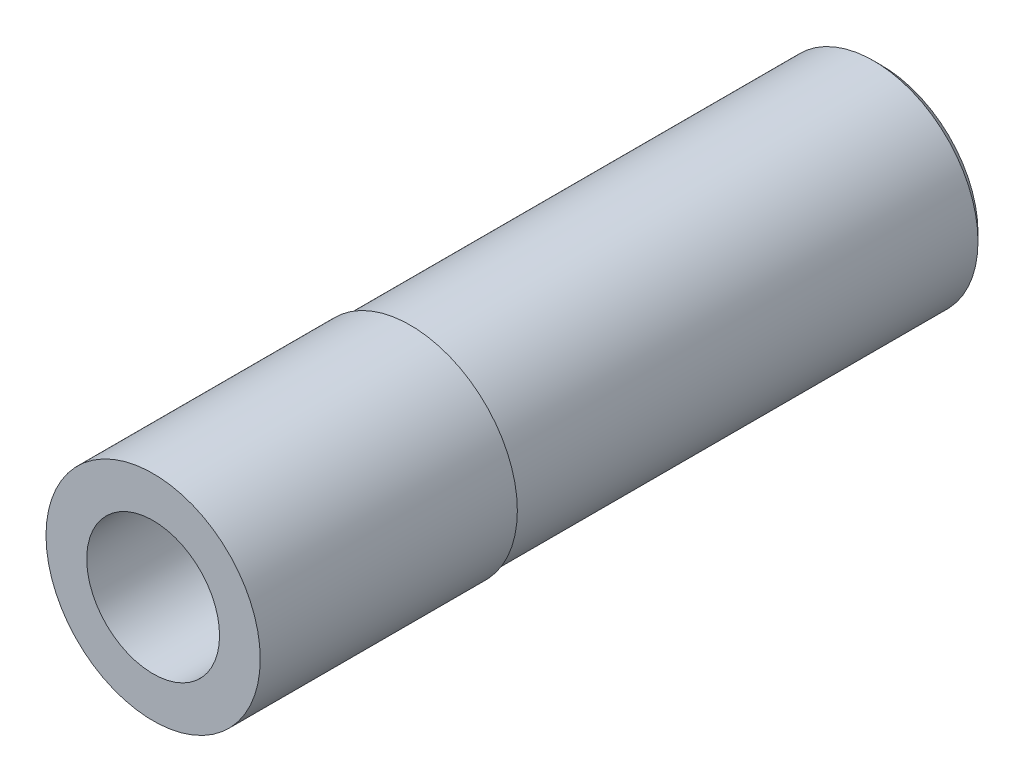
ISO-10303-21;
HEADER;
FILE_DESCRIPTION(('STEP AP214'),'2;1');
FILE_NAME('part.step','',(''),(''),'','','');
FILE_SCHEMA(('AUTOMOTIVE_DESIGN { 1 0 10303 214 1 1 1 1 }'));
ENDSEC;
DATA;
#1=APPLICATION_CONTEXT('core data for automotive mechanical design processes');
#2=APPLICATION_PROTOCOL_DEFINITION('international standard','automotive_design',2000,#1);
#3=PRODUCT_CONTEXT('',#1,'mechanical');
#4=PRODUCT('Part','Part','',(#3));
#5=PRODUCT_RELATED_PRODUCT_CATEGORY('part','',(#4));
#6=PRODUCT_DEFINITION_FORMATION('','',#4);
#7=PRODUCT_DEFINITION_CONTEXT('part definition',#1,'design');
#8=PRODUCT_DEFINITION('design','',#6,#7);
#9=PRODUCT_DEFINITION_SHAPE('','',#8);
#10=(LENGTH_UNIT() NAMED_UNIT(*) SI_UNIT(.MILLI.,.METRE.));
#11=(NAMED_UNIT(*) PLANE_ANGLE_UNIT() SI_UNIT($,.RADIAN.));
#12=(NAMED_UNIT(*) SI_UNIT($,.STERADIAN.) SOLID_ANGLE_UNIT());
#13=UNCERTAINTY_MEASURE_WITH_UNIT(LENGTH_MEASURE(1.E-05),#10,'distance_accuracy_value','');
#14=(GEOMETRIC_REPRESENTATION_CONTEXT(3) GLOBAL_UNCERTAINTY_ASSIGNED_CONTEXT((#13)) GLOBAL_UNIT_ASSIGNED_CONTEXT((#10,
#11,#12)) REPRESENTATION_CONTEXT('',''));
#15=CARTESIAN_POINT('',(0.,0.,0.));
#16=DIRECTION('',(0.,0.,1.));
#17=DIRECTION('',(1.,0.,0.));
#18=AXIS2_PLACEMENT_3D('',#15,#16,#17);
#19=CARTESIAN_POINT('',(0.,0.,3.79790950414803));
#20=DIRECTION('',(0.,0.,1.));
#21=DIRECTION('',(1.,0.,0.));
#22=AXIS2_PLACEMENT_3D('',#19,#20,#21);
#23=CYLINDRICAL_SURFACE('',#22,0.799999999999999);
#24=CARTESIAN_POINT('',(0.,0.,-14.));
#25=DIRECTION('',(0.,0.,1.));
#26=DIRECTION('',(1.,0.,0.));
#27=AXIS2_PLACEMENT_3D('',#24,#25,#26);
#28=CIRCLE('',#27,0.8);
#29=CARTESIAN_POINT('',(0.8,0.,-14.));
#30=VERTEX_POINT('',#29);
#31=EDGE_CURVE('E185',#30,#30,#28,.T.);
#32=ORIENTED_EDGE('',*,*,#31,.F.);
#33=EDGE_LOOP('',(#32));
#34=FACE_BOUND('',#33,.T.);
#35=CARTESIAN_POINT('',(0.,0.,-4.2));
#36=DIRECTION('',(0.,0.,1.));
#37=DIRECTION('',(1.,0.,0.));
#38=AXIS2_PLACEMENT_3D('',#35,#36,#37);
#39=CIRCLE('',#38,0.799999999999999);
#40=CARTESIAN_POINT('',(0.69282032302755,-0.399999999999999,-4.2));
#41=VERTEX_POINT('',#40);
#42=CARTESIAN_POINT('',(0.,-0.799999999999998,-4.2));
#43=VERTEX_POINT('',#42);
#44=EDGE_CURVE('E11',#41,#43,#39,.F.);
#45=ORIENTED_EDGE('',*,*,#44,.F.);
#46=CARTESIAN_POINT('',(0.69282032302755,0.399999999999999,-4.2));
#47=VERTEX_POINT('',#46);
#48=EDGE_CURVE('E38',#47,#41,#39,.F.);
#49=ORIENTED_EDGE('',*,*,#48,.F.);
#50=CARTESIAN_POINT('',(0.,0.799999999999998,-4.2));
#51=VERTEX_POINT('',#50);
#52=EDGE_CURVE('E111',#51,#47,#39,.F.);
#53=ORIENTED_EDGE('',*,*,#52,.F.);
#54=CARTESIAN_POINT('',(-0.69282032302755,0.399999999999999,-4.2));
#55=VERTEX_POINT('',#54);
#56=EDGE_CURVE('E296',#55,#51,#39,.F.);
#57=ORIENTED_EDGE('',*,*,#56,.F.);
#58=CARTESIAN_POINT('',(-0.692820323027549,-0.399999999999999,-4.2));
#59=VERTEX_POINT('',#58);
#60=EDGE_CURVE('E294',#59,#55,#39,.F.);
#61=ORIENTED_EDGE('',*,*,#60,.F.);
#62=EDGE_CURVE('E43',#43,#59,#39,.F.);
#63=ORIENTED_EDGE('',*,*,#62,.F.);
#64=EDGE_LOOP('',(#45,#49,#53,#57,#61,#63));
#65=FACE_BOUND('',#64,.T.);
#66=ADVANCED_FACE('F34',(#34,#65),#23,.F.);
#67=CARTESIAN_POINT('',(0.,0.,3.79790950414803));
#68=DIRECTION('',(0.,0.,1.));
#69=DIRECTION('',(1.,0.,0.));
#70=AXIS2_PLACEMENT_3D('',#67,#68,#69);
#71=CYLINDRICAL_SURFACE('',#70,2.5);
#72=CARTESIAN_POINT('',(0.,0.,0.));
#73=DIRECTION('',(0.,0.,1.));
#74=DIRECTION('',(1.,0.,0.));
#75=AXIS2_PLACEMENT_3D('',#72,#73,#74);
#76=CIRCLE('',#75,2.5);
#77=CARTESIAN_POINT('',(2.5,0.,0.));
#78=VERTEX_POINT('',#77);
#79=EDGE_CURVE('E194',#78,#78,#76,.T.);
#80=ORIENTED_EDGE('',*,*,#79,.F.);
#81=EDGE_LOOP('',(#80));
#82=FACE_BOUND('',#81,.T.);
#83=CARTESIAN_POINT('',(0.,0.,-6.));
#84=DIRECTION('',(0.,0.,-1.));
#85=DIRECTION('',(-1.,0.,0.));
#86=AXIS2_PLACEMENT_3D('',#83,#84,#85);
#87=CIRCLE('',#86,2.5);
#88=CARTESIAN_POINT('',(-2.5,0.,-6.));
#89=VERTEX_POINT('',#88);
#90=EDGE_CURVE('E179',#89,#89,#87,.T.);
#91=ORIENTED_EDGE('',*,*,#90,.F.);
#92=EDGE_LOOP('',(#91));
#93=FACE_BOUND('',#92,.T.);
#94=ADVANCED_FACE('F36',(#82,#93),#71,.T.);
#95=CARTESIAN_POINT('',(0.,0.,-17.));
#96=DIRECTION('',(0.,0.,1.));
#97=DIRECTION('',(1.,0.,0.));
#98=AXIS2_PLACEMENT_3D('',#95,#96,#97);
#99=CONICAL_SURFACE('',#98,2.2499999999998,0.785398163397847);
#100=CARTESIAN_POINT('',(0.,0.,-17.));
#101=DIRECTION('',(0.,0.,1.));
#102=DIRECTION('',(1.,0.,0.));
#103=AXIS2_PLACEMENT_3D('',#100,#101,#102);
#104=CIRCLE('',#103,2.2499999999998);
#105=CARTESIAN_POINT('',(2.2499999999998,0.,-17.));
#106=VERTEX_POINT('',#105);
#107=EDGE_CURVE('E175',#106,#106,#104,.T.);
#108=ORIENTED_EDGE('',*,*,#107,.T.);
#109=EDGE_LOOP('',(#108));
#110=FACE_BOUND('',#109,.T.);
#111=CARTESIAN_POINT('',(0.,0.,-16.815));
#112=DIRECTION('',(0.,0.,1.));
#113=DIRECTION('',(1.,0.,0.));
#114=AXIS2_PLACEMENT_3D('',#111,#112,#113);
#115=CIRCLE('',#114,2.435);
#116=CARTESIAN_POINT('',(2.435,0.,-16.815));
#117=VERTEX_POINT('',#116);
#118=EDGE_CURVE('E174',#117,#117,#115,.T.);
#119=ORIENTED_EDGE('',*,*,#118,.F.);
#120=EDGE_LOOP('',(#119));
#121=FACE_BOUND('',#120,.T.);
#122=ADVANCED_FACE('F204',(#110,#121),#99,.T.);
#123=CARTESIAN_POINT('',(0.,2.5,0.));
#124=DIRECTION('',(0.,0.,-1.));
#125=DIRECTION('',(-1.,0.,0.));
#126=AXIS2_PLACEMENT_3D('',#123,#124,#125);
#127=PLANE('',#126);
#128=CARTESIAN_POINT('',(0.,0.,0.));
#129=DIRECTION('',(0.,0.,1.));
#130=DIRECTION('',(1.,0.,0.));
#131=AXIS2_PLACEMENT_3D('',#128,#129,#130);
#132=CIRCLE('',#131,1.55);
#133=CARTESIAN_POINT('',(1.55,0.,0.));
#134=VERTEX_POINT('',#133);
#135=EDGE_CURVE('E191',#134,#134,#132,.T.);
#136=ORIENTED_EDGE('',*,*,#135,.F.);
#137=EDGE_LOOP('',(#136));
#138=FACE_BOUND('',#137,.T.);
#139=ORIENTED_EDGE('',*,*,#79,.T.);
#140=EDGE_LOOP('',(#139));
#141=FACE_BOUND('',#140,.T.);
#142=ADVANCED_FACE('F210',(#138,#141),#127,.F.);
#143=CARTESIAN_POINT('',(0.,0.,3.79790950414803));
#144=DIRECTION('',(0.,0.,1.));
#145=DIRECTION('',(1.,0.,0.));
#146=AXIS2_PLACEMENT_3D('',#143,#144,#145);
#147=CYLINDRICAL_SURFACE('',#146,1.55);
#148=CARTESIAN_POINT('',(0.,0.,-2.8));
#149=DIRECTION('',(0.,0.,1.));
#150=DIRECTION('',(1.,0.,0.));
#151=AXIS2_PLACEMENT_3D('',#148,#149,#150);
#152=CIRCLE('',#151,1.55);
#153=CARTESIAN_POINT('',(1.55,0.,-2.8));
#154=VERTEX_POINT('',#153);
#155=EDGE_CURVE('E188',#154,#154,#152,.T.);
#156=ORIENTED_EDGE('',*,*,#155,.F.);
#157=EDGE_LOOP('',(#156));
#158=FACE_BOUND('',#157,.T.);
#159=ORIENTED_EDGE('',*,*,#135,.T.);
#160=EDGE_LOOP('',(#159));
#161=FACE_BOUND('',#160,.T.);
#162=ADVANCED_FACE('F218',(#158,#161),#147,.F.);
#163=CARTESIAN_POINT('',(0.,1.55,-2.8));
#164=DIRECTION('',(0.,0.,-1.));
#165=DIRECTION('',(-1.,0.,0.));
#166=AXIS2_PLACEMENT_3D('',#163,#164,#165);
#167=PLANE('',#166);
#168=DIRECTION('',(-1.,0.,0.));
#169=VECTOR('',#168,1.);
#170=CARTESIAN_POINT('',(0.4618802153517,0.799999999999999,-2.8));
#171=LINE('',#170,#169);
#172=CARTESIAN_POINT('',(0.4618802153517,0.799999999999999,-2.8));
#173=VERTEX_POINT('',#172);
#174=CARTESIAN_POINT('',(-0.4618802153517,0.799999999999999,-2.8));
#175=VERTEX_POINT('',#174);
#176=EDGE_CURVE('E50',#173,#175,#171,.T.);
#177=ORIENTED_EDGE('',*,*,#176,.F.);
#178=DIRECTION('',(-0.5,0.866025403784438,0.));
#179=VECTOR('',#178,1.);
#180=CARTESIAN_POINT('',(0.9237604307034,0.,-2.8));
#181=LINE('',#180,#179);
#182=CARTESIAN_POINT('',(0.9237604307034,0.,-2.8));
#183=VERTEX_POINT('',#182);
#184=EDGE_CURVE('E120',#183,#173,#181,.T.);
#185=ORIENTED_EDGE('',*,*,#184,.F.);
#186=DIRECTION('',(0.5,0.866025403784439,0.));
#187=VECTOR('',#186,1.);
#188=CARTESIAN_POINT('',(0.4618802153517,-0.799999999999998,-2.8));
#189=LINE('',#188,#187);
#190=CARTESIAN_POINT('',(0.4618802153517,-0.799999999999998,-2.8));
#191=VERTEX_POINT('',#190);
#192=EDGE_CURVE('E114',#191,#183,#189,.T.);
#193=ORIENTED_EDGE('',*,*,#192,.F.);
#194=DIRECTION('',(1.,0.,0.));
#195=VECTOR('',#194,1.);
#196=CARTESIAN_POINT('',(-0.461880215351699,-0.799999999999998,-2.8));
#197=LINE('',#196,#195);
#198=CARTESIAN_POINT('',(-0.461880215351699,-0.799999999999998,-2.8));
#199=VERTEX_POINT('',#198);
#200=EDGE_CURVE('E154',#199,#191,#197,.T.);
#201=ORIENTED_EDGE('',*,*,#200,.F.);
#202=DIRECTION('',(0.5,-0.866025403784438,0.));
#203=VECTOR('',#202,1.);
#204=CARTESIAN_POINT('',(-0.923760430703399,0.,-2.8));
#205=LINE('',#204,#203);
#206=CARTESIAN_POINT('',(-0.923760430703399,0.,-2.8));
#207=VERTEX_POINT('',#206);
#208=EDGE_CURVE('E151',#207,#199,#205,.T.);
#209=ORIENTED_EDGE('',*,*,#208,.F.);
#210=DIRECTION('',(-0.5,-0.866025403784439,0.));
#211=VECTOR('',#210,1.);
#212=CARTESIAN_POINT('',(-0.4618802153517,0.799999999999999,-2.8));
#213=LINE('',#212,#211);
#214=EDGE_CURVE('E148',#175,#207,#213,.T.);
#215=ORIENTED_EDGE('',*,*,#214,.F.);
#216=EDGE_LOOP('',(#177,#185,#193,#201,#209,#215));
#217=FACE_BOUND('',#216,.T.);
#218=ORIENTED_EDGE('',*,*,#155,.T.);
#219=EDGE_LOOP('',(#218));
#220=FACE_BOUND('',#219,.T.);
#221=ADVANCED_FACE('F223',(#217,#220),#167,.F.);
#222=CARTESIAN_POINT('',(0.,0.8,-14.));
#223=DIRECTION('',(0.,0.,1.));
#224=DIRECTION('',(1.,0.,0.));
#225=AXIS2_PLACEMENT_3D('',#222,#223,#224);
#226=PLANE('',#225);
#227=CARTESIAN_POINT('',(0.,0.,-14.));
#228=DIRECTION('',(0.,0.,1.));
#229=DIRECTION('',(1.,0.,0.));
#230=AXIS2_PLACEMENT_3D('',#227,#228,#229);
#231=CIRCLE('',#230,1.5);
#232=CARTESIAN_POINT('',(1.5,0.,-14.));
#233=VERTEX_POINT('',#232);
#234=EDGE_CURVE('E182',#233,#233,#231,.T.);
#235=ORIENTED_EDGE('',*,*,#234,.F.);
#236=EDGE_LOOP('',(#235));
#237=FACE_BOUND('',#236,.T.);
#238=ORIENTED_EDGE('',*,*,#31,.T.);
#239=EDGE_LOOP('',(#238));
#240=FACE_BOUND('',#239,.T.);
#241=ADVANCED_FACE('F229',(#237,#240),#226,.F.);
#242=CARTESIAN_POINT('',(0.,0.,3.79790950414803));
#243=DIRECTION('',(0.,0.,1.));
#244=DIRECTION('',(1.,0.,0.));
#245=AXIS2_PLACEMENT_3D('',#242,#243,#244);
#246=CYLINDRICAL_SURFACE('',#245,1.5);
#247=CARTESIAN_POINT('',(0.,0.,-17.));
#248=DIRECTION('',(0.,0.,1.));
#249=DIRECTION('',(1.,0.,0.));
#250=AXIS2_PLACEMENT_3D('',#247,#248,#249);
#251=CIRCLE('',#250,1.5);
#252=CARTESIAN_POINT('',(1.5,0.,-17.));
#253=VERTEX_POINT('',#252);
#254=EDGE_CURVE('E178',#253,#253,#251,.T.);
#255=ORIENTED_EDGE('',*,*,#254,.F.);
#256=EDGE_LOOP('',(#255));
#257=FACE_BOUND('',#256,.T.);
#258=ORIENTED_EDGE('',*,*,#234,.T.);
#259=EDGE_LOOP('',(#258));
#260=FACE_BOUND('',#259,.T.);
#261=ADVANCED_FACE('F233',(#257,#260),#246,.F.);
#262=CARTESIAN_POINT('',(0.,1.5,-17.));
#263=DIRECTION('',(0.,0.,1.));
#264=DIRECTION('',(1.,0.,0.));
#265=AXIS2_PLACEMENT_3D('',#262,#263,#264);
#266=PLANE('',#265);
#267=ORIENTED_EDGE('',*,*,#107,.F.);
#268=EDGE_LOOP('',(#267));
#269=FACE_BOUND('',#268,.T.);
#270=ORIENTED_EDGE('',*,*,#254,.T.);
#271=EDGE_LOOP('',(#270));
#272=FACE_BOUND('',#271,.T.);
#273=ADVANCED_FACE('F237',(#269,#272),#266,.F.);
#274=CARTESIAN_POINT('',(0.,3.435,-6.));
#275=DIRECTION('',(0.,0.,-1.));
#276=DIRECTION('',(-1.,0.,0.));
#277=AXIS2_PLACEMENT_3D('',#274,#275,#276);
#278=PLANE('',#277);
#279=CARTESIAN_POINT('',(0.,0.,-6.));
#280=DIRECTION('',(0.,0.,1.));
#281=DIRECTION('',(1.,0.,0.));
#282=AXIS2_PLACEMENT_3D('',#279,#280,#281);
#283=CIRCLE('',#282,2.435);
#284=CARTESIAN_POINT('',(2.435,0.,-6.));
#285=VERTEX_POINT('',#284);
#286=EDGE_CURVE('E160',#285,#285,#283,.T.);
#287=ORIENTED_EDGE('',*,*,#286,.T.);
#288=EDGE_LOOP('',(#287));
#289=FACE_BOUND('',#288,.T.);
#290=ORIENTED_EDGE('',*,*,#90,.T.);
#291=EDGE_LOOP('',(#290));
#292=FACE_BOUND('',#291,.T.);
#293=ADVANCED_FACE('F201',(#289,#292),#278,.T.);
#294=CARTESIAN_POINT('',(0.,0.,0.));
#295=DIRECTION('',(0.,0.,1.));
#296=DIRECTION('',(1.,0.,0.));
#297=AXIS2_PLACEMENT_3D('',#294,#295,#296);
#298=CYLINDRICAL_SURFACE('',#297,2.435);
#299=ORIENTED_EDGE('',*,*,#286,.F.);
#300=EDGE_LOOP('',(#299));
#301=FACE_BOUND('',#300,.T.);
#302=ORIENTED_EDGE('',*,*,#118,.T.);
#303=EDGE_LOOP('',(#302));
#304=FACE_BOUND('',#303,.T.);
#305=ADVANCED_FACE('F244',(#301,#304),#298,.T.);
#306=CARTESIAN_POINT('',(0.9237604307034,0.,-4.2));
#307=DIRECTION('',(0.866025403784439,0.5,0.));
#308=DIRECTION('',(-0.5,0.866025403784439,0.));
#309=AXIS2_PLACEMENT_3D('',#306,#307,#308);
#310=PLANE('',#309);
#311=ORIENTED_EDGE('',*,*,#184,.T.);
#312=DIRECTION('',(0.,0.,1.));
#313=VECTOR('',#312,1.);
#314=CARTESIAN_POINT('',(0.4618802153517,0.799999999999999,-4.2));
#315=LINE('',#314,#313);
#316=CARTESIAN_POINT('',(0.4618802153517,0.799999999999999,-4.2));
#317=VERTEX_POINT('',#316);
#318=EDGE_CURVE('E117',#317,#173,#315,.T.);
#319=ORIENTED_EDGE('',*,*,#318,.F.);
#320=DIRECTION('',(-0.5,0.866025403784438,0.));
#321=VECTOR('',#320,1.);
#322=CARTESIAN_POINT('',(0.9237604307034,0.,-4.2));
#323=LINE('',#322,#321);
#324=EDGE_CURVE('E105',#47,#317,#323,.T.);
#325=ORIENTED_EDGE('',*,*,#324,.F.);
#326=CARTESIAN_POINT('',(0.9237604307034,0.,-4.2));
#327=VERTEX_POINT('',#326);
#328=EDGE_CURVE('E58',#327,#47,#323,.T.);
#329=ORIENTED_EDGE('',*,*,#328,.F.);
#330=DIRECTION('',(0.,0.,1.));
#331=VECTOR('',#330,1.);
#332=CARTESIAN_POINT('',(0.9237604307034,0.,-4.2));
#333=LINE('',#332,#331);
#334=EDGE_CURVE('E158',#327,#183,#333,.T.);
#335=ORIENTED_EDGE('',*,*,#334,.T.);
#336=EDGE_LOOP('',(#311,#319,#325,#329,#335));
#337=FACE_BOUND('',#336,.T.);
#338=ADVANCED_FACE('F118',(#337),#310,.F.);
#339=CARTESIAN_POINT('',(0.4618802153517,-0.799999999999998,-4.2));
#340=DIRECTION('',(0.866025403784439,-0.5,0.));
#341=DIRECTION('',(0.5,0.866025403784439,0.));
#342=AXIS2_PLACEMENT_3D('',#339,#340,#341);
#343=PLANE('',#342);
#344=ORIENTED_EDGE('',*,*,#192,.T.);
#345=ORIENTED_EDGE('',*,*,#334,.F.);
#346=DIRECTION('',(0.5,0.866025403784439,0.));
#347=VECTOR('',#346,1.);
#348=CARTESIAN_POINT('',(0.4618802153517,-0.799999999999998,-4.2));
#349=LINE('',#348,#347);
#350=EDGE_CURVE('E143',#41,#327,#349,.T.);
#351=ORIENTED_EDGE('',*,*,#350,.F.);
#352=CARTESIAN_POINT('',(0.4618802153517,-0.799999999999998,-4.2));
#353=VERTEX_POINT('',#352);
#354=EDGE_CURVE('E123',#353,#41,#349,.T.);
#355=ORIENTED_EDGE('',*,*,#354,.F.);
#356=DIRECTION('',(0.,0.,1.));
#357=VECTOR('',#356,1.);
#358=CARTESIAN_POINT('',(0.4618802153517,-0.799999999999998,-4.2));
#359=LINE('',#358,#357);
#360=EDGE_CURVE('E161',#353,#191,#359,.T.);
#361=ORIENTED_EDGE('',*,*,#360,.T.);
#362=EDGE_LOOP('',(#344,#345,#351,#355,#361));
#363=FACE_BOUND('',#362,.T.);
#364=ADVANCED_FACE('F251',(#363),#343,.F.);
#365=CARTESIAN_POINT('',(-0.461880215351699,-0.799999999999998,-4.2));
#366=DIRECTION('',(0.,-1.,0.));
#367=DIRECTION('',(0.,0.,-1.));
#368=AXIS2_PLACEMENT_3D('',#365,#366,#367);
#369=PLANE('',#368);
#370=ORIENTED_EDGE('',*,*,#200,.T.);
#371=ORIENTED_EDGE('',*,*,#360,.F.);
#372=DIRECTION('',(1.,0.,0.));
#373=VECTOR('',#372,1.);
#374=CARTESIAN_POINT('',(-0.461880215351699,-0.799999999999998,-4.2));
#375=LINE('',#374,#373);
#376=EDGE_CURVE('E139',#43,#353,#375,.T.);
#377=ORIENTED_EDGE('',*,*,#376,.F.);
#378=CARTESIAN_POINT('',(-0.461880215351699,-0.799999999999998,-4.2));
#379=VERTEX_POINT('',#378);
#380=EDGE_CURVE('E140',#379,#43,#375,.T.);
#381=ORIENTED_EDGE('',*,*,#380,.F.);
#382=DIRECTION('',(0.,0.,1.));
#383=VECTOR('',#382,1.);
#384=CARTESIAN_POINT('',(-0.461880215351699,-0.799999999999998,-4.2));
#385=LINE('',#384,#383);
#386=EDGE_CURVE('E164',#379,#199,#385,.T.);
#387=ORIENTED_EDGE('',*,*,#386,.T.);
#388=EDGE_LOOP('',(#370,#371,#377,#381,#387));
#389=FACE_BOUND('',#388,.T.);
#390=ADVANCED_FACE('F262',(#389),#369,.F.);
#391=CARTESIAN_POINT('',(-0.923760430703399,0.,-4.2));
#392=DIRECTION('',(-0.866025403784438,-0.5,0.));
#393=DIRECTION('',(0.5,-0.866025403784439,0.));
#394=AXIS2_PLACEMENT_3D('',#391,#392,#393);
#395=PLANE('',#394);
#396=ORIENTED_EDGE('',*,*,#208,.T.);
#397=ORIENTED_EDGE('',*,*,#386,.F.);
#398=DIRECTION('',(0.5,-0.866025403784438,0.));
#399=VECTOR('',#398,1.);
#400=CARTESIAN_POINT('',(-0.923760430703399,0.,-4.2));
#401=LINE('',#400,#399);
#402=EDGE_CURVE('E135',#59,#379,#401,.T.);
#403=ORIENTED_EDGE('',*,*,#402,.F.);
#404=CARTESIAN_POINT('',(-0.923760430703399,0.,-4.2));
#405=VERTEX_POINT('',#404);
#406=EDGE_CURVE('E136',#405,#59,#401,.T.);
#407=ORIENTED_EDGE('',*,*,#406,.F.);
#408=DIRECTION('',(0.,0.,1.));
#409=VECTOR('',#408,1.);
#410=CARTESIAN_POINT('',(-0.923760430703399,0.,-4.2));
#411=LINE('',#410,#409);
#412=EDGE_CURVE('E167',#405,#207,#411,.T.);
#413=ORIENTED_EDGE('',*,*,#412,.T.);
#414=EDGE_LOOP('',(#396,#397,#403,#407,#413));
#415=FACE_BOUND('',#414,.T.);
#416=ADVANCED_FACE('F258',(#415),#395,.F.);
#417=CARTESIAN_POINT('',(-0.4618802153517,0.799999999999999,-4.2));
#418=DIRECTION('',(-0.866025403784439,0.5,0.));
#419=DIRECTION('',(-0.5,-0.866025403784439,0.));
#420=AXIS2_PLACEMENT_3D('',#417,#418,#419);
#421=PLANE('',#420);
#422=ORIENTED_EDGE('',*,*,#214,.T.);
#423=ORIENTED_EDGE('',*,*,#412,.F.);
#424=DIRECTION('',(-0.5,-0.866025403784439,0.));
#425=VECTOR('',#424,1.);
#426=CARTESIAN_POINT('',(-0.4618802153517,0.799999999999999,-4.2));
#427=LINE('',#426,#425);
#428=EDGE_CURVE('E129',#55,#405,#427,.T.);
#429=ORIENTED_EDGE('',*,*,#428,.F.);
#430=CARTESIAN_POINT('',(-0.4618802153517,0.799999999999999,-4.2));
#431=VERTEX_POINT('',#430);
#432=EDGE_CURVE('E131',#431,#55,#427,.T.);
#433=ORIENTED_EDGE('',*,*,#432,.F.);
#434=DIRECTION('',(0.,0.,1.));
#435=VECTOR('',#434,1.);
#436=CARTESIAN_POINT('',(-0.4618802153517,0.799999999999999,-4.2));
#437=LINE('',#436,#435);
#438=EDGE_CURVE('E122',#431,#175,#437,.T.);
#439=ORIENTED_EDGE('',*,*,#438,.T.);
#440=EDGE_LOOP('',(#422,#423,#429,#433,#439));
#441=FACE_BOUND('',#440,.T.);
#442=ADVANCED_FACE('F255',(#441),#421,.F.);
#443=CARTESIAN_POINT('',(0.4618802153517,0.799999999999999,-4.2));
#444=DIRECTION('',(0.,1.,0.));
#445=DIRECTION('',(-1.,0.,0.));
#446=AXIS2_PLACEMENT_3D('',#443,#444,#445);
#447=PLANE('',#446);
#448=ORIENTED_EDGE('',*,*,#176,.T.);
#449=ORIENTED_EDGE('',*,*,#438,.F.);
#450=DIRECTION('',(-1.,0.,0.));
#451=VECTOR('',#450,1.);
#452=CARTESIAN_POINT('',(0.4618802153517,0.799999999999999,-4.2));
#453=LINE('',#452,#451);
#454=EDGE_CURVE('E128',#51,#431,#453,.T.);
#455=ORIENTED_EDGE('',*,*,#454,.F.);
#456=EDGE_CURVE('E109',#317,#51,#453,.T.);
#457=ORIENTED_EDGE('',*,*,#456,.F.);
#458=ORIENTED_EDGE('',*,*,#318,.T.);
#459=EDGE_LOOP('',(#448,#449,#455,#457,#458));
#460=FACE_BOUND('',#459,.T.);
#461=ADVANCED_FACE('F126',(#460),#447,.F.);
#462=CARTESIAN_POINT('',(0.4618802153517,0.799999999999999,-4.2));
#463=DIRECTION('',(0.,0.,1.));
#464=DIRECTION('',(1.,0.,0.));
#465=AXIS2_PLACEMENT_3D('',#462,#463,#464);
#466=PLANE('',#465);
#467=ORIENTED_EDGE('',*,*,#44,.T.);
#468=ORIENTED_EDGE('',*,*,#376,.T.);
#469=ORIENTED_EDGE('',*,*,#354,.T.);
#470=EDGE_LOOP('',(#467,#468,#469));
#471=FACE_BOUND('',#470,.T.);
#472=ADVANCED_FACE('F254',(#471),#466,.T.);
#473=ORIENTED_EDGE('',*,*,#62,.T.);
#474=ORIENTED_EDGE('',*,*,#402,.T.);
#475=ORIENTED_EDGE('',*,*,#380,.T.);
#476=EDGE_LOOP('',(#473,#474,#475));
#477=FACE_BOUND('',#476,.T.);
#478=ADVANCED_FACE('F271',(#477),#466,.T.);
#479=ORIENTED_EDGE('',*,*,#60,.T.);
#480=ORIENTED_EDGE('',*,*,#428,.T.);
#481=ORIENTED_EDGE('',*,*,#406,.T.);
#482=EDGE_LOOP('',(#479,#480,#481));
#483=FACE_BOUND('',#482,.T.);
#484=ADVANCED_FACE('F277',(#483),#466,.T.);
#485=ORIENTED_EDGE('',*,*,#56,.T.);
#486=ORIENTED_EDGE('',*,*,#454,.T.);
#487=ORIENTED_EDGE('',*,*,#432,.T.);
#488=EDGE_LOOP('',(#485,#486,#487));
#489=FACE_BOUND('',#488,.T.);
#490=ADVANCED_FACE('F283',(#489),#466,.T.);
#491=ORIENTED_EDGE('',*,*,#52,.T.);
#492=ORIENTED_EDGE('',*,*,#324,.T.);
#493=ORIENTED_EDGE('',*,*,#456,.T.);
#494=EDGE_LOOP('',(#491,#492,#493));
#495=FACE_BOUND('',#494,.T.);
#496=ADVANCED_FACE('F107',(#495),#466,.T.);
#497=ORIENTED_EDGE('',*,*,#48,.T.);
#498=ORIENTED_EDGE('',*,*,#350,.T.);
#499=ORIENTED_EDGE('',*,*,#328,.T.);
#500=EDGE_LOOP('',(#497,#498,#499));
#501=FACE_BOUND('',#500,.T.);
#502=ADVANCED_FACE('F273',(#501),#466,.T.);
#503=CLOSED_SHELL('',(#66,#94,#122,#142,#162,#221,#241,#261,#273,#293,#305,#338,#364,#390,#416,
#442,#461,#472,#478,#484,#490,#496,#502));
#504=MANIFOLD_SOLID_BREP('B2',#503);
#505=ADVANCED_BREP_SHAPE_REPRESENTATION('',(#18,#504),#14);
#506=SHAPE_DEFINITION_REPRESENTATION(#9,#505);
ENDSEC;
END-ISO-10303-21;
